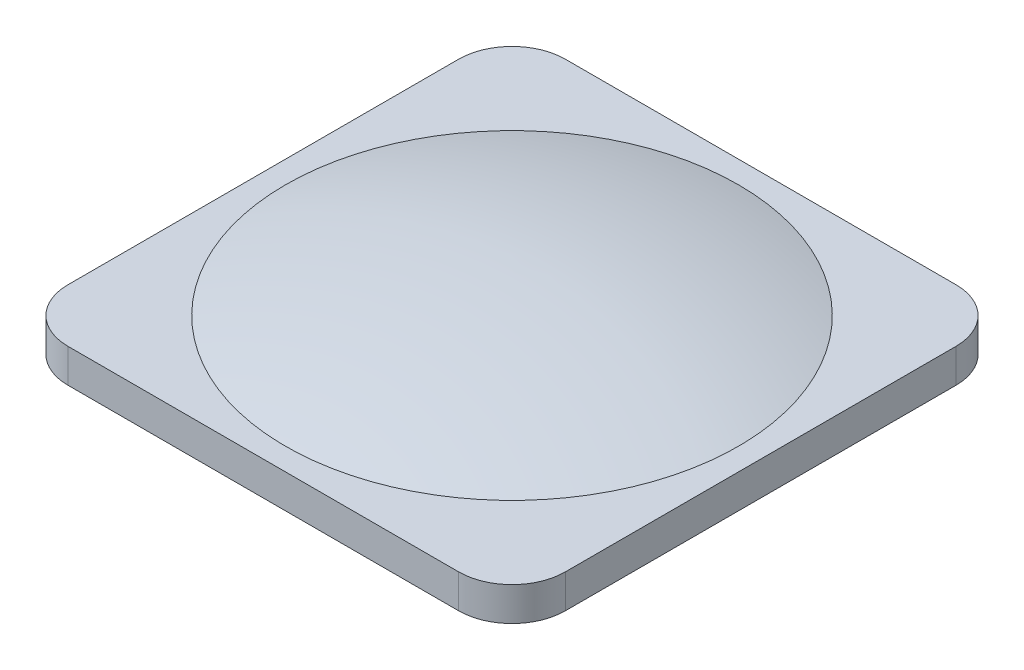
from build123d import *

# Parameters (mm, degrees)
SKIZZE1_W               = 140
SKIZZE1_H               = 140
LINEAR_AUSTRAGEN1_DEPTH = 9.5
VERRUNDUNG1_R           = 15
WANDUNG3_T              = -1.5


with BuildPart() as part:
    # Skizze1 → Linear austragen1 (new body)
    with BuildSketch(Plane(origin=(0, 0, 0), x_dir=(1, 0, 0), z_dir=(0, 1, 0))):
        with Locations((70, 70)):
            Rectangle(SKIZZE1_W, SKIZZE1_H)
    extrude(amount=LINEAR_AUSTRAGEN1_DEPTH)

    # Verrundung1
    verrundung1_edges = [part.edges().sort_by_distance(p)[0] for p in [
        (0, 4.75, -140),
        (140, 4.75, -140),
        (140, 4.75, 0),
        (0, 4.75, 0),
    ]]
    fillet(verrundung1_edges, radius=VERRUNDUNG1_R)

    # Skizze3 → Rotation2 (revolve)
    with BuildSketch(Plane.XY.offset(-70)):
        with BuildLine():
            ThreePointArc((6.25, 9.5), (37.735226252, 16.984807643), (70, 19.5))
            Line((70, 19.5), (70, 9.5))
            Line((70, 9.5), (6.25, 9.5))
        make_face()
    revolve(axis=Axis((70, 9.5, -70), (0, 1, 0)))

    # Wandung3
    wandung3_openings = [part.faces().sort_by_distance(p)[0] for p in [
        (70, 0, -70),
    ]]
    offset(amount=WANDUNG3_T, openings=wandung3_openings, kind=Kind.INTERSECTION)


solid = part.part
